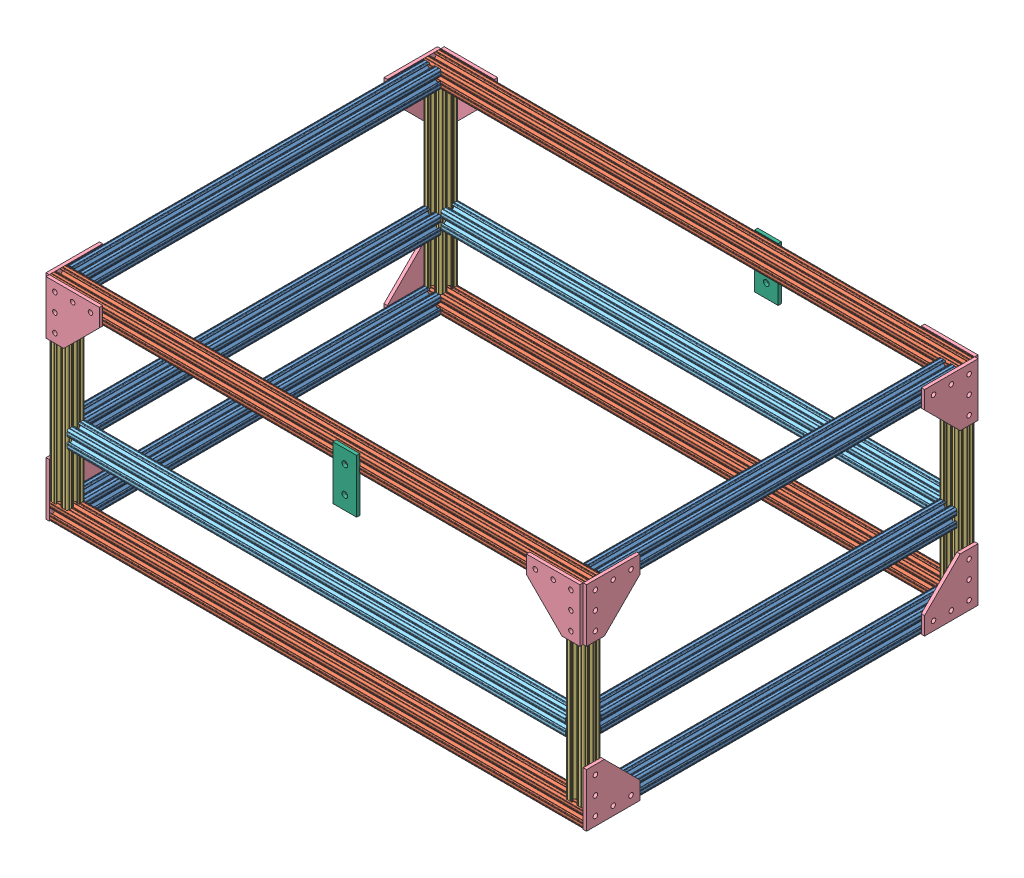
SolidWorks assembly Base Without Wheels+Plate.SLDASM, configuration Default (file format 10000). Lengths in mm.
Overall size (771.55 304.86 568.83).
30 component instances, 6 part files, 77 mates.
Components (placement in the parent):
- 1010 20in-2: 1010 20in.SLDPRT [Default] at (231.3281 508 268.5426) size (25.4 25.4 508)
- 1010 30in-1: 1010 30in.SLDPRT [Default] at (-517.9719 508 281.2426) x (0 0 1) z (-1 0 0) size (25.4 25.4 762)
- 1010 30in-2: 1010 30in.SLDPRT [Default] at (-517.9719 508 -252.1574) x (0 0 1) z (-1 0 0) size (25.4 25.4 762)
- 1010 20in-3: 1010 20in.SLDPRT [Default] at (-505.2719 508 268.5426) size (25.4 25.4 508)
- 1010 10in-1: 1010 10in.SLDPRT [Default] at (231.3281 520.7 281.2426) x (1 0 0) z (0 -1 0) size (25.4 25.4 254)
- 1010 10in-2: 1010 10in.SLDPRT [Default] at (231.3281 520.7 -252.1574) x (1 0 0) z (0 -1 0) size (25.4 25.4 254)
- 1010 10in-3: 1010 10in.SLDPRT [Default] at (-505.2719 520.7 -252.1574) x (1 0 0) z (0 -1 0) size (25.4 25.4 254)
- 1010 10in-4: 1010 10in.SLDPRT [Default] at (-505.2719 520.7 281.2426) x (1 0 0) z (0 -1 0) size (25.4 25.4 254)
- 1010 30in-3: 1010 30in.SLDPRT [Default] at (244.0281 787.4 -252.1574) x (0 0 -1) z (1 0 0) size (25.4 25.4 762)
- 1010 20in-4: 1010 20in.SLDPRT [Default] at (231.3281 787.4 268.5426) size (25.4 25.4 508)
- 1010 30in-4: 1010 30in.SLDPRT [Default] at (-517.9719 787.4 281.2426) x (0 -1 0) z (-1 0 0) size (25.4 25.4 762)
- 1010 20in-5: 1010 20in.SLDPRT [Default] at (-505.2719 787.4 268.5426) size (25.4 25.4 508)
- 4151-1: 4151.sldprt [Default] at (248.8033 495.3 255.8426) x (0 0 1) z (-1 0 0) size (76.2 76.2 4.78)
- 4151-2: 4151.sldprt [Default] at (244.0281 495.3 -226.7574) x (0 0 -1) z (1 0 0) size (76.2 76.2 4.78)
- 4151-3: 4151.sldprt [Default] at (-522.7471 533.4 293.9426) x (0 -1 0) z (1 0 0) size (76.2 76.2 4.78)
- 4151-4: 4151.sldprt [Default] at (-522.7471 495.3 -226.7574) x (0 0 -1) z (1 0 0) size (76.2 76.2 4.78)
- 4151-5: 4151.sldprt [Default] at (248.8033 800.1 -226.7574) x (0 0 -1) z (-1 0 0) size (76.2 76.2 4.78)
- 4151-6: 4151.sldprt [Default] at (248.8033 762 293.9426) x (0 1 0) z (-1 0 0) size (76.2 76.2 4.78)
- 4151-7: 4151.sldprt [Default] at (244.0281 762 293.9426) x (0 1 0) z (0 0 1) size (76.2 76.2 4.78)
- 4151-8: 4151.sldprt [Default] at (244.0281 762 -269.6326) x (0 1 0) z (0 0 1) size (76.2 76.2 4.78)
- 4151-9: 4151.sldprt [Default] at (-522.7471 762 -264.8574) x (0 1 0) z (1 0 0) size (76.2 76.2 4.78)
- 4151-10: 4151.sldprt [Default] at (-522.7471 800.1 255.8426) x (0 0 1) z (1 0 0) size (76.2 76.2 4.78)
- 4151-11: 4151.sldprt [Default] at (-517.9719 762 298.7178) x (0 1 0) z (0 0 -1) size (76.2 76.2 4.78)
- 4151-12: 4151.sldprt [Default] at (-517.9719 762 -264.8574) x (0 1 0) z (0 0 -1) size (76.2 76.2 4.78)
- 1010 28in-1: 1010 28in.SLDPRT [Default] at (-492.5719 608.8386 281.2426) x (0 0 1) z (-1 0 0) size (25.4 25.4 711.2)
- 1010 28in-2: 1010 28in.SLDPRT [Default] at (-492.5719 612.9856 -252.1574) x (0 0 1) z (-1 0 0) size (25.4 25.4 711.2)
- 1010 20in-6: 1010 20in.SLDPRT [Default] at (231.3281 612.74 268.5426) size (25.4 25.4 508)
- 1010 20in-7: 1010 20in.SLDPRT [Default] at (-505.2719 606.9045 268.5426) size (25.4 25.4 508)
- Mad Ants Base Design Plate-1: Mad Ants Base Design Plate.SLDPRT [Default] at (-91.9558 761.9341 293.5259) size (33.78 76.45 4.67)
- Mad Ants Base Design Plate-2: Mad Ants Base Design Plate.SLDPRT [Default] at (-53.9332 760.9111 -270.1149) size (33.78 76.45 4.67)
Mates (geometry in assembly coordinates):
- Coincident5: coincident aligned: plane of 1010 20in-2 through (244.0281 514.3331 -239.4574) normal (1 0 0); plane of 1010 30in-1 through (244.0281 500.3292 279.5333) normal (1 0 0)
- Coincident6: coincident anti-aligned: plane of 1010 20in-2 through (229.6188 500.3292 268.5426) normal (0 0 1); plane of 1010 30in-1 through (244.0281 498.4496 268.5426) normal (0 0 -1)
- Coincident7: coincident aligned: plane of 1010 20in-2 through (221.7776 520.7 -239.4574) normal (0 1 0); plane of 1010 30in-1 through (244.0281 520.7 271.6921) normal (0 1 0)
- Coincident8: coincident anti-aligned: plane of 1010 20in-2 through (229.6188 500.3292 -239.4574) normal (0 0 -1); plane of 1010 30in-2 through (244.0281 514.3331 -239.4574) normal (0 0 1)
- Coincident9: coincident aligned: plane of 1010 20in-2 through (244.0281 514.3331 -239.4574) normal (1 0 0); plane of 1010 30in-2 through (244.0281 500.3292 -253.8667) normal (1 0 0)
- Coincident10: coincident aligned: plane of 1010 20in-2 through (221.7776 520.7 -239.4574) normal (0 1 0); plane of 1010 30in-2 through (244.0281 520.7 -242.607) normal (0 1 0)
- Coincident11: coincident anti-aligned: plane of 1010 30in-2 through (244.0281 514.3331 -239.4574) normal (0 0 1); plane of 1010 20in-3 through (-506.9812 500.3292 -239.4574) normal (0 0 -1)
- Coincident12: coincident aligned: plane of 1010 30in-2 through (244.0281 520.7 -242.607) normal (0 1 0); plane of 1010 20in-3 through (-514.8224 520.7 -239.4574) normal (0 1 0)
- Coincident13: coincident aligned: plane of 1010 30in-2 through (-517.9719 500.3292 -253.8667) normal (-1 0 0); plane of 1010 20in-3 through (-517.9719 514.3331 -239.4574) normal (-1 0 0)
- Coincident14: coincident anti-aligned: plane of 1010 30in-1 through (244.0281 520.7 271.6921) normal (0 1 0); plane of 1010 10in-1 through (229.6188 520.7 273.5718) normal (0 -1 0)
- Coincident15: coincident aligned: plane of 1010 30in-1 through (244.0281 500.3292 279.5333) normal (1 0 0); plane of 1010 10in-1 through (244.0281 774.7 287.5756) normal (1 0 0)
- Coincident16: coincident aligned: plane of 1010 30in-1 through (244.0281 514.3331 293.9426) normal (0 0 1); plane of 1010 10in-1 through (221.7776 774.7 293.9426) normal (0 0 1)
- Coincident17: coincident anti-aligned: plane of 1010 30in-2 through (244.0281 520.7 -261.7079) normal (0 1 0); plane of 1010 10in-2 through (229.6188 520.7 -259.8282) normal (0 -1 0)
- Coincident18: coincident aligned: plane of 1010 30in-2 through (244.0281 500.3292 -253.8667) normal (1 0 0); plane of 1010 10in-2 through (244.0281 774.7 -245.8244) normal (1 0 0)
- Coincident19: coincident aligned: plane of 1010 30in-2 through (244.0281 514.3331 -264.8574) normal (0 0 -1); plane of 1010 10in-2 through (224.9949 774.7 -264.8574) normal (0 0 -1)
- Coincident20: coincident anti-aligned: plane of 1010 30in-2 through (244.0281 520.7 -261.7079) normal (0 1 0); plane of 1010 10in-3 through (-506.9812 520.7 -259.8282) normal (0 -1 0)
- Coincident21: coincident aligned: plane of 1010 30in-2 through (-517.9719 500.3292 -253.8667) normal (-1 0 0); plane of 1010 10in-3 through (-517.9719 774.7 -261.7078) normal (-1 0 0)
- Coincident22: coincident aligned: plane of 1010 30in-2 through (244.0281 514.3331 -264.8574) normal (0 0 -1); plane of 1010 10in-3 through (-511.6051 774.7 -264.8574) normal (0 0 -1)
- Coincident23: coincident anti-aligned: plane of 1010 30in-1 through (244.0281 520.7 271.6921) normal (0 1 0); plane of 1010 10in-4 through (-506.9812 520.7 273.5718) normal (0 -1 0)
- Coincident24: coincident aligned: plane of 1010 30in-1 through (-517.9719 500.3292 279.5333) normal (-1 0 0); plane of 1010 10in-4 through (-517.9719 774.7 287.5756) normal (-1 0 0)
- Coincident25: coincident aligned: plane of 1010 30in-1 through (244.0281 514.3331 293.9426) normal (0 0 1); plane of 1010 10in-4 through (-514.8224 774.7 293.9426) normal (0 0 1)
- Coincident28: coincident anti-aligned: plane of 1010 10in-2 through (229.6188 774.7 -259.8282) normal (0 1 0); plane of 1010 30in-3 through (-517.9719 774.7 -245.8243) normal (0 -1 0)
- Coincident29: coincident aligned: plane of 1010 10in-2 through (244.0281 774.7 -261.7078) normal (1 0 0); plane of 1010 30in-3 through (244.0281 779.7292 -250.4482) normal (1 0 0)
- Coincident30: coincident aligned: plane of 1010 10in-2 through (221.7776 774.7 -239.4574) normal (0 0 1); plane of 1010 30in-3 through (-517.9719 793.7331 -239.4574) normal (0 0 1)
- Coincident31: coincident anti-aligned: plane of 1010 30in-3 through (-517.9719 793.7331 -239.4574) normal (0 0 1); plane of 1010 20in-4 through (229.6188 779.7292 -239.4574) normal (0 0 -1)
- Coincident32: coincident aligned: plane of 1010 30in-3 through (244.0281 779.7292 -250.4482) normal (1 0 0); plane of 1010 20in-4 through (244.0281 793.7331 -239.4574) normal (1 0 0)
- Coincident33: coincident aligned: plane of 1010 30in-3 through (-517.9719 800.1 -242.607) normal (0 1 0); plane of 1010 20in-4 through (221.7776 800.1 -239.4574) normal (0 1 0)
- Coincident34: coincident aligned: plane of 1010 20in-4 through (244.0281 793.7331 -239.4574) normal (1 0 0); plane of 1010 30in-4 through (244.0281 789.1093 273.5718) normal (1 0 0)
- Coincident35: coincident anti-aligned: plane of 1010 20in-4 through (229.6188 779.7292 268.5426) normal (0 0 1); plane of 1010 30in-4 through (244.0281 793.7331 268.5426) normal (0 0 -1)
- Coincident36: coincident aligned: plane of 1010 20in-4 through (221.7776 800.1 -239.4574) normal (0 1 0); plane of 1010 30in-4 through (244.0281 800.1 271.6922) normal (0 1 0)
- Coincident37: coincident anti-aligned: plane of 1010 30in-3 through (-517.9719 793.7331 -239.4574) normal (0 0 1); plane of 1010 20in-5 through (-506.9812 779.7292 -239.4574) normal (0 0 -1)
- Coincident38: coincident aligned: plane of 1010 30in-3 through (-517.9719 800.1 -242.607) normal (0 1 0); plane of 1010 20in-5 through (-514.8224 800.1 -239.4574) normal (0 1 0)
- Coincident39: coincident aligned: plane of 1010 30in-3 through (-517.9719 779.7292 -250.4482) normal (-1 0 0); plane of 1010 20in-5 through (-517.9719 777.8496 -239.4574) normal (-1 0 0)
- Coincident40: coincident aligned: plane of 1010 30in-1 through (244.0281 498.4496 293.9426) normal (0 0 1); plane of 4151-1 through (248.8033 495.3 293.9426) normal (0 0 1)
- Coincident41: coincident anti-aligned: plane of 1010 30in-1 through (244.0281 500.3292 279.5333) normal (1 0 0); plane of 4151-1 through (244.0281 495.3 255.8426) normal (-1 0 0)
- Tangent1: tangent aligned: cylinder of 1010 30in-1 through (244.0281 497.4082 291.8344) axis (-1 0 0) radius 2.1082; plane of 4151-1 through (248.8033 495.3 217.7426) normal (0 -1 0)
- Coincident42: coincident anti-aligned: plane of 1010 30in-2 through (244.0281 500.3292 -253.8667) normal (1 0 0); plane of 4151-2 through (244.0281 495.3 -226.7574) normal (-1 0 0)
- Coincident43: coincident aligned: plane of 1010 30in-2 through (244.0281 495.3 -245.8243) normal (0 -1 0); plane of 4151-2 through (244.0281 495.3 -188.6574) normal (0 -1 0)
- Coincident44: coincident aligned: plane of 1010 30in-2 through (244.0281 498.4496 -264.8574) normal (0 0 -1); plane of 4151-2 through (244.0281 495.3 -264.8574) normal (0 0 -1)
- Coincident45: coincident anti-aligned: plane of 1010 30in-1 through (-517.9719 500.3292 279.5333) normal (-1 0 0); plane of 4151-3 through (-517.9719 533.4 293.9426) normal (1 0 0)
- Coincident46: coincident aligned: plane of 1010 30in-1 through (244.0281 514.3331 293.9426) normal (0 0 1); plane of 4151-3 through (-522.7471 571.5 293.9426) normal (0 0 1)
- Coincident47: coincident aligned: plane of 1010 20in-3 through (-511.6051 495.3 -239.4574) normal (0 -1 0); plane of 4151-3 through (-522.7471 495.3 293.9426) normal (0 -1 0)
- Coincident48: coincident anti-aligned: plane of 1010 30in-2 through (-517.9719 500.3292 -253.8667) normal (-1 0 0); plane of 4151-4 through (-517.9719 495.3 -226.7574) normal (1 0 0)
- Coincident49: coincident aligned: plane of 1010 30in-2 through (244.0281 495.3 -245.8243) normal (0 -1 0); plane of 4151-4 through (-522.7471 495.3 -188.6574) normal (0 -1 0)
- Coincident50: coincident aligned: plane of 1010 10in-3 through (-511.6051 774.7 -264.8574) normal (0 0 -1); plane of 4151-4 through (-522.7471 495.3 -264.8574) normal (0 0 -1)
- Coincident51: coincident anti-aligned: plane of 1010 30in-3 through (244.0281 779.7292 -250.4482) normal (1 0 0); plane of 4151-5 through (244.0281 800.1 -226.7574) normal (-1 0 0)
- Coincident52: coincident aligned: plane of 1010 30in-3 through (-517.9719 800.1 -242.607) normal (0 1 0); plane of 4151-5 through (248.8033 800.1 -188.6574) normal (0 1 0)
- Coincident53: coincident aligned: plane of 1010 30in-3 through (-517.9719 793.7331 -264.8574) normal (0 0 -1); plane of 4151-5 through (248.8033 800.1 -264.8574) normal (0 0 -1)
- Coincident54: coincident anti-aligned: plane of 1010 30in-4 through (244.0281 789.1093 273.5718) normal (1 0 0); plane of 4151-6 through (244.0281 762 293.9426) normal (-1 0 0)
- Coincident55: coincident aligned: plane of 1010 30in-4 through (244.0281 796.9504 293.9426) normal (0 0 1); plane of 4151-6 through (248.8033 723.9 293.9426) normal (0 0 1)
- Coincident56: coincident aligned: plane of 1010 20in-4 through (240.8785 800.1 -239.4574) normal (0 1 0); plane of 4151-6 through (248.8033 800.1 293.9426) normal (0 1 0)
- Coincident57: coincident anti-aligned: plane of 1010 30in-4 through (244.0281 796.9504 293.9426) normal (0 0 1); plane of 4151-7 through (244.0281 762 293.9426) normal (0 0 -1)
- Coincident58: coincident aligned: plane of 1010 30in-4 through (244.0281 800.1 287.5756) normal (0 1 0); plane of 4151-7 through (244.0281 800.1 293.9426) normal (0 1 0)
- Coincident59: coincident: line of 4151-6 through (244.0281 723.9 293.9426) axis (0 1 0); plane of 4151-7 through (244.0281 723.9 293.9426) normal (1 0 0)
- Coincident60: coincident anti-aligned: plane of 1010 30in-3 through (-517.9719 793.7331 -264.8574) normal (0 0 -1); plane of 4151-8 through (244.0281 762 -264.8574) normal (0 0 1)
- Coincident61: coincident aligned: plane of 1010 30in-3 through (-517.9719 800.1 -261.7079) normal (0 1 0); plane of 4151-8 through (244.0281 800.1 -269.6326) normal (0 1 0)
- Coincident62: coincident: line of 4151-5 through (244.0281 800.1 -264.8574) axis (0 -1 0); plane of 4151-8 through (244.0281 723.9 -269.6326) normal (1 0 0)
- Coincident63: coincident anti-aligned: plane of 1010 30in-3 through (-517.9719 779.7292 -250.4482) normal (-1 0 0); plane of 4151-9 through (-517.9719 762 -264.8574) normal (1 0 0)
- Coincident64: coincident aligned: plane of 1010 30in-3 through (-517.9719 800.1 -242.607) normal (0 1 0); plane of 4151-9 through (-522.7471 800.1 -264.8574) normal (0 1 0)
- Coincident65: coincident aligned: plane of 1010 30in-3 through (-517.9719 793.7331 -264.8574) normal (0 0 -1); plane of 4151-9 through (-522.7471 723.9 -264.8574) normal (0 0 -1)
- Coincident66: coincident anti-aligned: plane of 1010 30in-4 through (-517.9719 789.1093 273.5718) normal (-1 0 0); plane of 4151-10 through (-517.9719 800.1 255.8426) normal (1 0 0)
- Coincident67: coincident aligned: plane of 1010 30in-4 through (244.0281 800.1 271.6922) normal (0 1 0); plane of 4151-10 through (-522.7471 800.1 217.7426) normal (0 1 0)
- Coincident68: coincident aligned: plane of 1010 30in-4 through (244.0281 796.9504 293.9426) normal (0 0 1); plane of 4151-10 through (-522.7471 800.1 293.9426) normal (0 0 1)
- Coincident69: coincident anti-aligned: plane of 1010 30in-4 through (244.0281 796.9504 293.9426) normal (0 0 1); plane of 4151-11 through (-517.9719 762 293.9426) normal (0 0 -1)
- Coincident70: coincident aligned: plane of 1010 30in-4 through (244.0281 800.1 287.5756) normal (0 1 0); plane of 4151-11 through (-517.9719 800.1 298.7178) normal (0 1 0)
- Coincident71: coincident: line of 4151-10 through (-517.9719 800.1 293.9426) axis (0 -1 0); plane of 4151-11 through (-517.9719 723.9 298.7178) normal (-1 0 0)
- Coincident72: coincident anti-aligned: plane of 1010 30in-3 through (-517.9719 793.7331 -264.8574) normal (0 0 -1); plane of 4151-12 through (-517.9719 762 -264.8574) normal (0 0 1)
- Coincident73: coincident aligned: plane of 1010 30in-3 through (-517.9719 800.1 -261.7079) normal (0 1 0); plane of 4151-12 through (-517.9719 800.1 -264.8574) normal (0 1 0)
- Coincident74: coincident: line of 4151-9 through (-517.9719 723.9 -264.8574) axis (0 1 0); plane of 4151-12 through (-517.9719 723.9 -264.8574) normal (-1 0 0)
- Coincident75: coincident anti-aligned: plane of 1010 10in-1 through (218.6281 774.7 271.6922) normal (-1 0 0); plane of 1010 28in-1 through (218.6281 601.1678 279.5333) normal (1 0 0)
- Coincident76: coincident anti-aligned: plane of 1010 10in-2 through (218.6281 774.7 -261.7078) normal (-1 0 0); plane of 1010 28in-2 through (218.6281 605.3148 -253.8667) normal (1 0 0)
- Coincident77: coincident aligned: plane of 1010 10in-2 through (224.9949 774.7 -264.8574) normal (0 0 -1); plane of 1010 28in-2 through (218.6281 619.3187 -264.8574) normal (0 0 -1)
- Coincident78: coincident aligned: plane of 1010 10in-1 through (221.7776 774.7 293.9426) normal (0 0 1); plane of 1010 28in-1 through (218.6281 615.1717 293.9426) normal (0 0 1)
- Coincident79: coincident anti-aligned: plane of 1010 10in-2 through (240.8785 774.7 -239.4574) normal (0 0 1); plane of 1010 20in-6 through (229.6188 605.0692 -239.4574) normal (0 0 -1)
- Coincident80: coincident aligned: plane of 1010 10in-2 through (244.0281 774.7 -245.8244) normal (1 0 0); plane of 1010 20in-6 through (244.0281 619.0731 -239.4574) normal (1 0 0)
- Coincident81: coincident anti-aligned: plane of 1010 10in-3 through (-514.8224 774.7 -239.4574) normal (0 0 1); plane of 1010 20in-7 through (-506.9812 599.2337 -239.4574) normal (0 0 -1)
- Coincident82: coincident aligned: plane of 1010 10in-3 through (-517.9719 774.7 -245.8244) normal (-1 0 0); plane of 1010 20in-7 through (-517.9719 613.2376 -239.4574) normal (-1 0 0)
